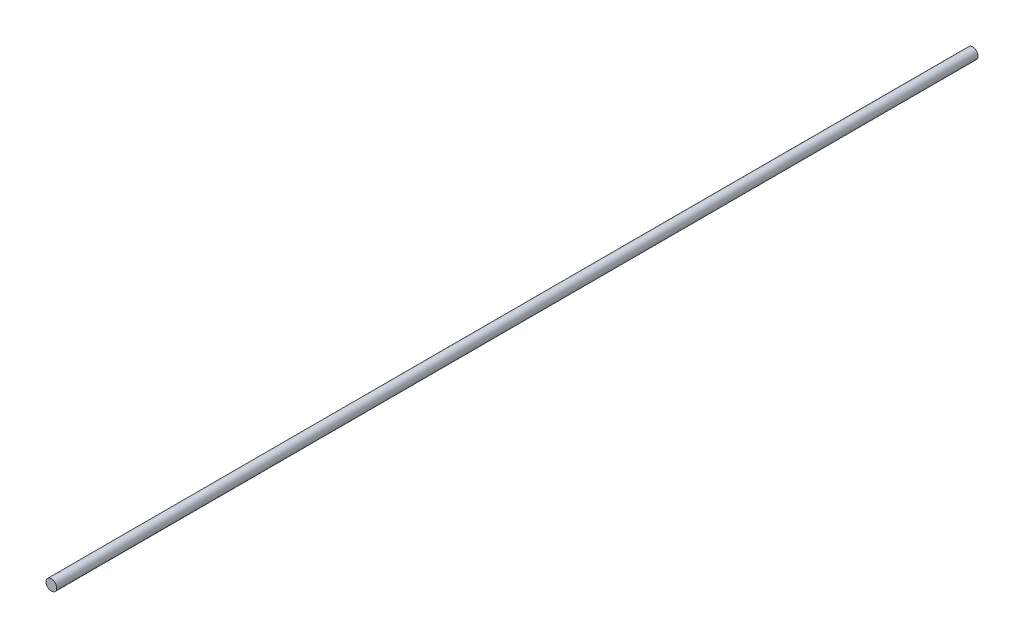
ISO-10303-21;
HEADER;
FILE_DESCRIPTION(('STEP AP214'),'2;1');
FILE_NAME('part.step','',(''),(''),'','','');
FILE_SCHEMA(('AUTOMOTIVE_DESIGN { 1 0 10303 214 1 1 1 1 }'));
ENDSEC;
DATA;
#1=APPLICATION_CONTEXT('core data for automotive mechanical design processes');
#2=APPLICATION_PROTOCOL_DEFINITION('international standard','automotive_design',2000,#1);
#3=PRODUCT_CONTEXT('',#1,'mechanical');
#4=PRODUCT('Part','Part','',(#3));
#5=PRODUCT_RELATED_PRODUCT_CATEGORY('part','',(#4));
#6=PRODUCT_DEFINITION_FORMATION('','',#4);
#7=PRODUCT_DEFINITION_CONTEXT('part definition',#1,'design');
#8=PRODUCT_DEFINITION('design','',#6,#7);
#9=PRODUCT_DEFINITION_SHAPE('','',#8);
#10=(LENGTH_UNIT() NAMED_UNIT(*) SI_UNIT(.MILLI.,.METRE.));
#11=(NAMED_UNIT(*) PLANE_ANGLE_UNIT() SI_UNIT($,.RADIAN.));
#12=(NAMED_UNIT(*) SI_UNIT($,.STERADIAN.) SOLID_ANGLE_UNIT());
#13=UNCERTAINTY_MEASURE_WITH_UNIT(LENGTH_MEASURE(1.E-05),#10,'distance_accuracy_value','');
#14=(GEOMETRIC_REPRESENTATION_CONTEXT(3) GLOBAL_UNCERTAINTY_ASSIGNED_CONTEXT((#13)) GLOBAL_UNIT_ASSIGNED_CONTEXT((#10,
#11,#12)) REPRESENTATION_CONTEXT('',''));
#15=CARTESIAN_POINT('',(0.,0.,0.));
#16=DIRECTION('',(0.,0.,1.));
#17=DIRECTION('',(1.,0.,0.));
#18=AXIS2_PLACEMENT_3D('',#15,#16,#17);
#19=CARTESIAN_POINT('',(0.,0.,-5150.));
#20=DIRECTION('',(0.,0.,1.));
#21=DIRECTION('',(1.,0.,0.));
#22=AXIS2_PLACEMENT_3D('',#19,#20,#21);
#23=CYLINDRICAL_SURFACE('',#22,30.);
#24=CARTESIAN_POINT('',(0.,0.,-5150.));
#25=DIRECTION('',(0.,0.,1.));
#26=DIRECTION('',(1.,0.,0.));
#27=AXIS2_PLACEMENT_3D('',#24,#25,#26);
#28=CIRCLE('',#27,30.);
#29=CARTESIAN_POINT('',(30.,0.,-5150.));
#30=VERTEX_POINT('',#29);
#31=EDGE_CURVE('E10',#30,#30,#28,.T.);
#32=ORIENTED_EDGE('',*,*,#31,.T.);
#33=EDGE_LOOP('',(#32));
#34=FACE_BOUND('',#33,.T.);
#35=CARTESIAN_POINT('',(0.,0.,0.));
#36=DIRECTION('',(0.,0.,1.));
#37=DIRECTION('',(1.,0.,0.));
#38=AXIS2_PLACEMENT_3D('',#35,#36,#37);
#39=CIRCLE('',#38,30.);
#40=CARTESIAN_POINT('',(30.,0.,0.));
#41=VERTEX_POINT('',#40);
#42=EDGE_CURVE('E40',#41,#41,#39,.T.);
#43=ORIENTED_EDGE('',*,*,#42,.F.);
#44=EDGE_LOOP('',(#43));
#45=FACE_BOUND('',#44,.T.);
#46=ADVANCED_FACE('F37',(#34,#45),#23,.T.);
#47=CARTESIAN_POINT('',(0.,0.,-5150.));
#48=DIRECTION('',(0.,0.,1.));
#49=DIRECTION('',(1.,0.,0.));
#50=AXIS2_PLACEMENT_3D('',#47,#48,#49);
#51=PLANE('',#50);
#52=ORIENTED_EDGE('',*,*,#31,.F.);
#53=EDGE_LOOP('',(#52));
#54=FACE_BOUND('',#53,.T.);
#55=ADVANCED_FACE('F54',(#54),#51,.F.);
#56=CARTESIAN_POINT('',(0.,0.,0.));
#57=DIRECTION('',(0.,0.,1.));
#58=DIRECTION('',(1.,0.,0.));
#59=AXIS2_PLACEMENT_3D('',#56,#57,#58);
#60=PLANE('',#59);
#61=ORIENTED_EDGE('',*,*,#42,.T.);
#62=EDGE_LOOP('',(#61));
#63=FACE_BOUND('',#62,.T.);
#64=ADVANCED_FACE('F51',(#63),#60,.T.);
#65=CLOSED_SHELL('',(#46,#55,#64));
#66=MANIFOLD_SOLID_BREP('B2',#65);
#67=ADVANCED_BREP_SHAPE_REPRESENTATION('',(#18,#66),#14);
#68=SHAPE_DEFINITION_REPRESENTATION(#9,#67);
ENDSEC;
END-ISO-10303-21;
